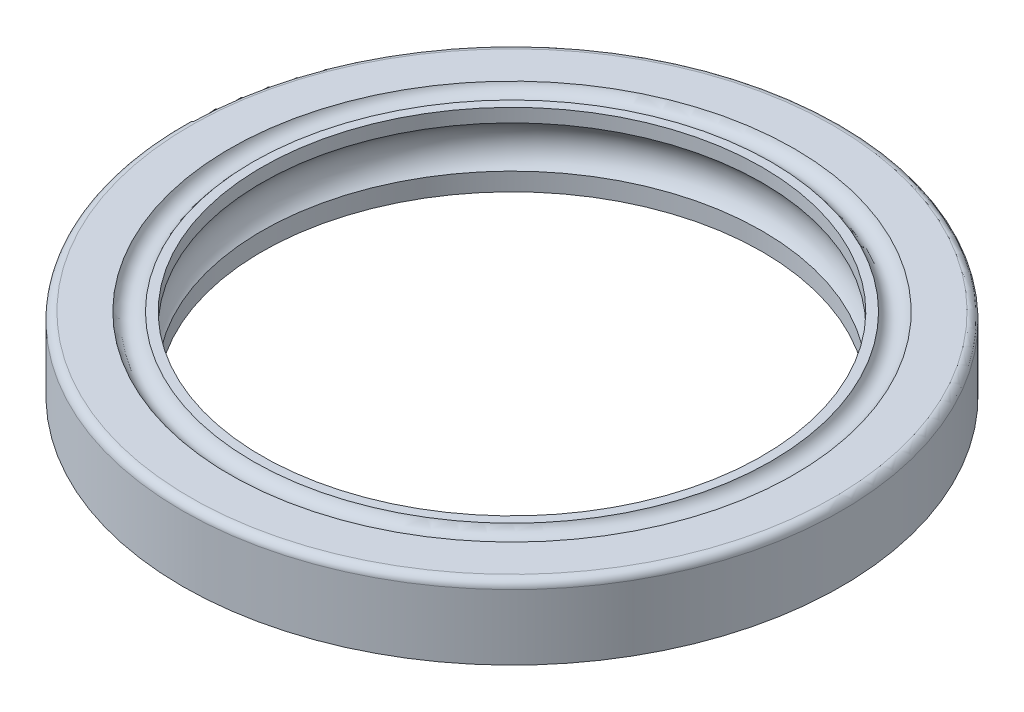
ISO-10303-21;
HEADER;
FILE_DESCRIPTION(('STEP AP214'),'2;1');
FILE_NAME('part.step','',(''),(''),'','','');
FILE_SCHEMA(('AUTOMOTIVE_DESIGN { 1 0 10303 214 1 1 1 1 }'));
ENDSEC;
DATA;
#1=APPLICATION_CONTEXT('core data for automotive mechanical design processes');
#2=APPLICATION_PROTOCOL_DEFINITION('international standard','automotive_design',2000,#1);
#3=PRODUCT_CONTEXT('',#1,'mechanical');
#4=PRODUCT('Part','Part','',(#3));
#5=PRODUCT_RELATED_PRODUCT_CATEGORY('part','',(#4));
#6=PRODUCT_DEFINITION_FORMATION('','',#4);
#7=PRODUCT_DEFINITION_CONTEXT('part definition',#1,'design');
#8=PRODUCT_DEFINITION('design','',#6,#7);
#9=PRODUCT_DEFINITION_SHAPE('','',#8);
#10=(LENGTH_UNIT() NAMED_UNIT(*) SI_UNIT(.MILLI.,.METRE.));
#11=(NAMED_UNIT(*) PLANE_ANGLE_UNIT() SI_UNIT($,.RADIAN.));
#12=(NAMED_UNIT(*) SI_UNIT($,.STERADIAN.) SOLID_ANGLE_UNIT());
#13=UNCERTAINTY_MEASURE_WITH_UNIT(LENGTH_MEASURE(1.E-05),#10,'distance_accuracy_value','');
#14=(GEOMETRIC_REPRESENTATION_CONTEXT(3) GLOBAL_UNCERTAINTY_ASSIGNED_CONTEXT((#13)) GLOBAL_UNIT_ASSIGNED_CONTEXT((#10,
#11,#12)) REPRESENTATION_CONTEXT('',''));
#15=CARTESIAN_POINT('',(0.,0.,0.));
#16=DIRECTION('',(0.,0.,1.));
#17=DIRECTION('',(1.,0.,0.));
#18=AXIS2_PLACEMENT_3D('',#15,#16,#17);
#19=CARTESIAN_POINT('',(25.6477892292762,0.,0.));
#20=DIRECTION('',(0.,-1.,0.));
#21=DIRECTION('',(0.,0.,-1.));
#22=AXIS2_PLACEMENT_3D('',#19,#20,#21);
#23=PLANE('',#22);
#24=CARTESIAN_POINT('',(0.,0.,0.));
#25=DIRECTION('',(0.,-1.,0.));
#26=DIRECTION('',(0.,0.,-1.));
#27=AXIS2_PLACEMENT_3D('',#24,#25,#26);
#28=CIRCLE('',#27,27.0002);
#29=CARTESIAN_POINT('',(0.,0.,-27.0002));
#30=VERTEX_POINT('',#29);
#31=EDGE_CURVE('E10',#30,#30,#28,.T.);
#32=ORIENTED_EDGE('',*,*,#31,.T.);
#33=EDGE_LOOP('',(#32));
#34=FACE_BOUND('',#33,.T.);
#35=CARTESIAN_POINT('',(0.,0.,0.));
#36=DIRECTION('',(0.,-1.,0.));
#37=DIRECTION('',(0.,0.,-1.));
#38=AXIS2_PLACEMENT_3D('',#35,#36,#37);
#39=CIRCLE('',#38,25.6477892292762);
#40=CARTESIAN_POINT('',(0.,0.,-25.6477892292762));
#41=VERTEX_POINT('',#40);
#42=EDGE_CURVE('E91',#41,#41,#39,.T.);
#43=ORIENTED_EDGE('',*,*,#42,.F.);
#44=EDGE_LOOP('',(#43));
#45=FACE_BOUND('',#44,.T.);
#46=ADVANCED_FACE('F36',(#34,#45),#23,.T.);
#47=CARTESIAN_POINT('',(0.,0.,0.));
#48=DIRECTION('',(0.,-1.,0.));
#49=DIRECTION('',(0.,0.,-1.));
#50=AXIS2_PLACEMENT_3D('',#47,#48,#49);
#51=CYLINDRICAL_SURFACE('',#50,27.0002);
#52=CARTESIAN_POINT('',(0.,5.3594,0.));
#53=DIRECTION('',(0.,-1.,0.));
#54=DIRECTION('',(0.,0.,-1.));
#55=AXIS2_PLACEMENT_3D('',#52,#53,#54);
#56=CIRCLE('',#55,27.0002);
#57=CARTESIAN_POINT('',(0.,5.3594,-27.0002));
#58=VERTEX_POINT('',#57);
#59=EDGE_CURVE('E43',#58,#58,#56,.T.);
#60=ORIENTED_EDGE('',*,*,#59,.T.);
#61=EDGE_LOOP('',(#60));
#62=FACE_BOUND('',#61,.T.);
#63=ORIENTED_EDGE('',*,*,#31,.F.);
#64=EDGE_LOOP('',(#63));
#65=FACE_BOUND('',#64,.T.);
#66=ADVANCED_FACE('F100',(#62,#65),#51,.T.);
#67=CARTESIAN_POINT('',(0.,5.3594,0.));
#68=DIRECTION('',(0.,-1.,0.));
#69=DIRECTION('',(0.,0.,-1.));
#70=AXIS2_PLACEMENT_3D('',#67,#68,#69);
#71=TOROIDAL_SURFACE('',#70,26.3652,0.634999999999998);
#72=CARTESIAN_POINT('',(0.,5.9944,0.));
#73=DIRECTION('',(0.,-1.,0.));
#74=DIRECTION('',(0.,0.,-1.));
#75=AXIS2_PLACEMENT_3D('',#72,#73,#74);
#76=CIRCLE('',#75,26.3652);
#77=CARTESIAN_POINT('',(0.,5.9944,-26.3652));
#78=VERTEX_POINT('',#77);
#79=EDGE_CURVE('E48',#78,#78,#76,.T.);
#80=ORIENTED_EDGE('',*,*,#79,.T.);
#81=EDGE_LOOP('',(#80));
#82=FACE_BOUND('',#81,.T.);
#83=ORIENTED_EDGE('',*,*,#59,.F.);
#84=EDGE_LOOP('',(#83));
#85=FACE_BOUND('',#84,.T.);
#86=ADVANCED_FACE('F104',(#82,#85),#71,.T.);
#87=CARTESIAN_POINT('',(26.3652,5.99439999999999,0.));
#88=DIRECTION('',(0.,1.,0.));
#89=DIRECTION('',(0.,0.,1.));
#90=AXIS2_PLACEMENT_3D('',#87,#88,#89);
#91=PLANE('',#90);
#92=CARTESIAN_POINT('',(0.,5.99439999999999,0.));
#93=DIRECTION('',(0.,-1.,0.));
#94=DIRECTION('',(0.,0.,-1.));
#95=AXIS2_PLACEMENT_3D('',#92,#93,#94);
#96=CIRCLE('',#95,23.1267637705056);
#97=CARTESIAN_POINT('',(0.,5.99439999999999,-23.1267637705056));
#98=VERTEX_POINT('',#97);
#99=EDGE_CURVE('E54',#98,#98,#96,.T.);
#100=ORIENTED_EDGE('',*,*,#99,.T.);
#101=EDGE_LOOP('',(#100));
#102=FACE_BOUND('',#101,.T.);
#103=ORIENTED_EDGE('',*,*,#79,.F.);
#104=EDGE_LOOP('',(#103));
#105=FACE_BOUND('',#104,.T.);
#106=ADVANCED_FACE('F108',(#102,#105),#91,.T.);
#107=CARTESIAN_POINT('',(0.,6.36628149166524,0.));
#108=DIRECTION('',(0.,-1.,0.));
#109=DIRECTION('',(0.,0.,-1.));
#110=AXIS2_PLACEMENT_3D('',#107,#108,#109);
#111=TOROIDAL_SURFACE('',#110,22.1812691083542,1.016);
#112=CARTESIAN_POINT('',(0.,5.9944,0.));
#113=DIRECTION('',(0.,-1.,0.));
#114=DIRECTION('',(0.,0.,-1.));
#115=AXIS2_PLACEMENT_3D('',#112,#113,#114);
#116=CIRCLE('',#115,21.2357744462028);
#117=CARTESIAN_POINT('',(0.,5.9944,-21.2357744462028));
#118=VERTEX_POINT('',#117);
#119=EDGE_CURVE('E60',#118,#118,#116,.T.);
#120=ORIENTED_EDGE('',*,*,#119,.T.);
#121=EDGE_LOOP('',(#120));
#122=FACE_BOUND('',#121,.T.);
#123=ORIENTED_EDGE('',*,*,#99,.F.);
#124=EDGE_LOOP('',(#123));
#125=FACE_BOUND('',#124,.T.);
#126=ADVANCED_FACE('F115',(#122,#125),#111,.F.);
#127=CARTESIAN_POINT('',(21.2357744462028,5.9944,0.));
#128=DIRECTION('',(0.,1.,0.));
#129=DIRECTION('',(0.,0.,1.));
#130=AXIS2_PLACEMENT_3D('',#127,#128,#129);
#131=PLANE('',#130);
#132=CARTESIAN_POINT('',(0.,5.9944,0.));
#133=DIRECTION('',(0.,-1.,0.));
#134=DIRECTION('',(0.,0.,-1.));
#135=AXIS2_PLACEMENT_3D('',#132,#133,#134);
#136=CIRCLE('',#135,20.4978);
#137=CARTESIAN_POINT('',(0.,5.9944,-20.4978));
#138=VERTEX_POINT('',#137);
#139=EDGE_CURVE('E64',#138,#138,#136,.T.);
#140=ORIENTED_EDGE('',*,*,#139,.T.);
#141=EDGE_LOOP('',(#140));
#142=FACE_BOUND('',#141,.T.);
#143=ORIENTED_EDGE('',*,*,#119,.F.);
#144=EDGE_LOOP('',(#143));
#145=FACE_BOUND('',#144,.T.);
#146=ADVANCED_FACE('F119',(#142,#145),#131,.T.);
#147=CARTESIAN_POINT('',(0.,0.,0.));
#148=DIRECTION('',(0.,-1.,0.));
#149=DIRECTION('',(0.,0.,-1.));
#150=AXIS2_PLACEMENT_3D('',#147,#148,#149);
#151=CYLINDRICAL_SURFACE('',#150,20.4978);
#152=CARTESIAN_POINT('',(0.,4.89045699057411,0.));
#153=DIRECTION('',(0.,-1.,0.));
#154=DIRECTION('',(0.,0.,-1.));
#155=AXIS2_PLACEMENT_3D('',#152,#153,#154);
#156=CIRCLE('',#155,20.4978);
#157=CARTESIAN_POINT('',(0.,4.89045699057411,-20.4978));
#158=VERTEX_POINT('',#157);
#159=EDGE_CURVE('E68',#158,#158,#156,.T.);
#160=ORIENTED_EDGE('',*,*,#159,.T.);
#161=EDGE_LOOP('',(#160));
#162=FACE_BOUND('',#161,.T.);
#163=ORIENTED_EDGE('',*,*,#139,.F.);
#164=EDGE_LOOP('',(#163));
#165=FACE_BOUND('',#164,.T.);
#166=ADVANCED_FACE('F123',(#162,#165),#151,.F.);
#167=CARTESIAN_POINT('',(0.,3.18012252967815,0.));
#168=DIRECTION('',(0.,-1.,0.));
#169=DIRECTION('',(0.,0.,-1.));
#170=AXIS2_PLACEMENT_3D('',#167,#168,#169);
#171=TOROIDAL_SURFACE('',#170,18.9778843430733,2.28809693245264);
#172=CARTESIAN_POINT('',(0.,1.46978806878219,0.));
#173=DIRECTION('',(0.,-1.,0.));
#174=DIRECTION('',(0.,0.,-1.));
#175=AXIS2_PLACEMENT_3D('',#172,#173,#174);
#176=CIRCLE('',#175,20.4978);
#177=CARTESIAN_POINT('',(0.,1.46978806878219,-20.4978));
#178=VERTEX_POINT('',#177);
#179=EDGE_CURVE('E72',#178,#178,#176,.T.);
#180=ORIENTED_EDGE('',*,*,#179,.T.);
#181=EDGE_LOOP('',(#180));
#182=FACE_BOUND('',#181,.T.);
#183=ORIENTED_EDGE('',*,*,#159,.F.);
#184=EDGE_LOOP('',(#183));
#185=FACE_BOUND('',#184,.T.);
#186=ADVANCED_FACE('F127',(#182,#185),#171,.F.);
#187=CARTESIAN_POINT('',(0.,0.,0.));
#188=DIRECTION('',(0.,-1.,0.));
#189=DIRECTION('',(0.,0.,-1.));
#190=AXIS2_PLACEMENT_3D('',#187,#188,#189);
#191=CYLINDRICAL_SURFACE('',#190,20.4978);
#192=CARTESIAN_POINT('',(0.,0.,0.));
#193=DIRECTION('',(0.,-1.,0.));
#194=DIRECTION('',(0.,0.,-1.));
#195=AXIS2_PLACEMENT_3D('',#192,#193,#194);
#196=CIRCLE('',#195,20.4978);
#197=CARTESIAN_POINT('',(0.,0.,-20.4978));
#198=VERTEX_POINT('',#197);
#199=EDGE_CURVE('E76',#198,#198,#196,.T.);
#200=ORIENTED_EDGE('',*,*,#199,.T.);
#201=EDGE_LOOP('',(#200));
#202=FACE_BOUND('',#201,.T.);
#203=ORIENTED_EDGE('',*,*,#179,.F.);
#204=EDGE_LOOP('',(#203));
#205=FACE_BOUND('',#204,.T.);
#206=ADVANCED_FACE('F131',(#202,#205),#191,.F.);
#207=CARTESIAN_POINT('',(20.4978,0.,0.));
#208=DIRECTION('',(0.,-1.,0.));
#209=DIRECTION('',(0.,0.,-1.));
#210=AXIS2_PLACEMENT_3D('',#207,#208,#209);
#211=PLANE('',#210);
#212=CARTESIAN_POINT('',(0.,0.,0.));
#213=DIRECTION('',(0.,-1.,0.));
#214=DIRECTION('',(0.,0.,-1.));
#215=AXIS2_PLACEMENT_3D('',#212,#213,#214);
#216=CIRCLE('',#215,22.7154155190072);
#217=CARTESIAN_POINT('',(0.,0.,-22.7154155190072));
#218=VERTEX_POINT('',#217);
#219=EDGE_CURVE('E80',#218,#218,#216,.T.);
#220=ORIENTED_EDGE('',*,*,#219,.T.);
#221=EDGE_LOOP('',(#220));
#222=FACE_BOUND('',#221,.T.);
#223=ORIENTED_EDGE('',*,*,#199,.F.);
#224=EDGE_LOOP('',(#223));
#225=FACE_BOUND('',#224,.T.);
#226=ADVANCED_FACE('F135',(#222,#225),#211,.T.);
#227=CARTESIAN_POINT('',(0.,0.,0.));
#228=DIRECTION('',(0.,-1.,0.));
#229=DIRECTION('',(0.,0.,-1.));
#230=AXIS2_PLACEMENT_3D('',#227,#228,#229);
#231=CYLINDRICAL_SURFACE('',#230,22.7154155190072);
#232=CARTESIAN_POINT('',(0.,4.14052012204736,0.));
#233=DIRECTION('',(0.,-1.,0.));
#234=DIRECTION('',(0.,0.,-1.));
#235=AXIS2_PLACEMENT_3D('',#232,#233,#234);
#236=CIRCLE('',#235,22.7154155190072);
#237=CARTESIAN_POINT('',(0.,4.14052012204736,-22.7154155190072));
#238=VERTEX_POINT('',#237);
#239=EDGE_CURVE('E84',#238,#238,#236,.T.);
#240=ORIENTED_EDGE('',*,*,#239,.T.);
#241=EDGE_LOOP('',(#240));
#242=FACE_BOUND('',#241,.T.);
#243=ORIENTED_EDGE('',*,*,#219,.F.);
#244=EDGE_LOOP('',(#243));
#245=FACE_BOUND('',#244,.T.);
#246=ADVANCED_FACE('F139',(#242,#245),#231,.T.);
#247=CARTESIAN_POINT('',(22.7154155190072,4.14052012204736,0.));
#248=DIRECTION('',(0.,-1.,0.));
#249=DIRECTION('',(0.,0.,-1.));
#250=AXIS2_PLACEMENT_3D('',#247,#248,#249);
#251=PLANE('',#250);
#252=CARTESIAN_POINT('',(0.,4.14052012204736,0.));
#253=DIRECTION('',(0.,-1.,0.));
#254=DIRECTION('',(0.,0.,-1.));
#255=AXIS2_PLACEMENT_3D('',#252,#253,#254);
#256=CIRCLE('',#255,25.6477892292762);
#257=CARTESIAN_POINT('',(0.,4.14052012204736,-25.6477892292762));
#258=VERTEX_POINT('',#257);
#259=EDGE_CURVE('E88',#258,#258,#256,.T.);
#260=ORIENTED_EDGE('',*,*,#259,.T.);
#261=EDGE_LOOP('',(#260));
#262=FACE_BOUND('',#261,.T.);
#263=ORIENTED_EDGE('',*,*,#239,.F.);
#264=EDGE_LOOP('',(#263));
#265=FACE_BOUND('',#264,.T.);
#266=ADVANCED_FACE('F143',(#262,#265),#251,.T.);
#267=CARTESIAN_POINT('',(0.,0.,0.));
#268=DIRECTION('',(0.,-1.,0.));
#269=DIRECTION('',(0.,0.,-1.));
#270=AXIS2_PLACEMENT_3D('',#267,#268,#269);
#271=CYLINDRICAL_SURFACE('',#270,25.6477892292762);
#272=ORIENTED_EDGE('',*,*,#42,.T.);
#273=EDGE_LOOP('',(#272));
#274=FACE_BOUND('',#273,.T.);
#275=ORIENTED_EDGE('',*,*,#259,.F.);
#276=EDGE_LOOP('',(#275));
#277=FACE_BOUND('',#276,.T.);
#278=ADVANCED_FACE('F96',(#274,#277),#271,.F.);
#279=CLOSED_SHELL('',(#46,#66,#86,#106,#126,#146,#166,#186,#206,#226,#246,#266,#278));
#280=MANIFOLD_SOLID_BREP('B2',#279);
#281=ADVANCED_BREP_SHAPE_REPRESENTATION('',(#18,#280),#14);
#282=SHAPE_DEFINITION_REPRESENTATION(#9,#281);
ENDSEC;
END-ISO-10303-21;
